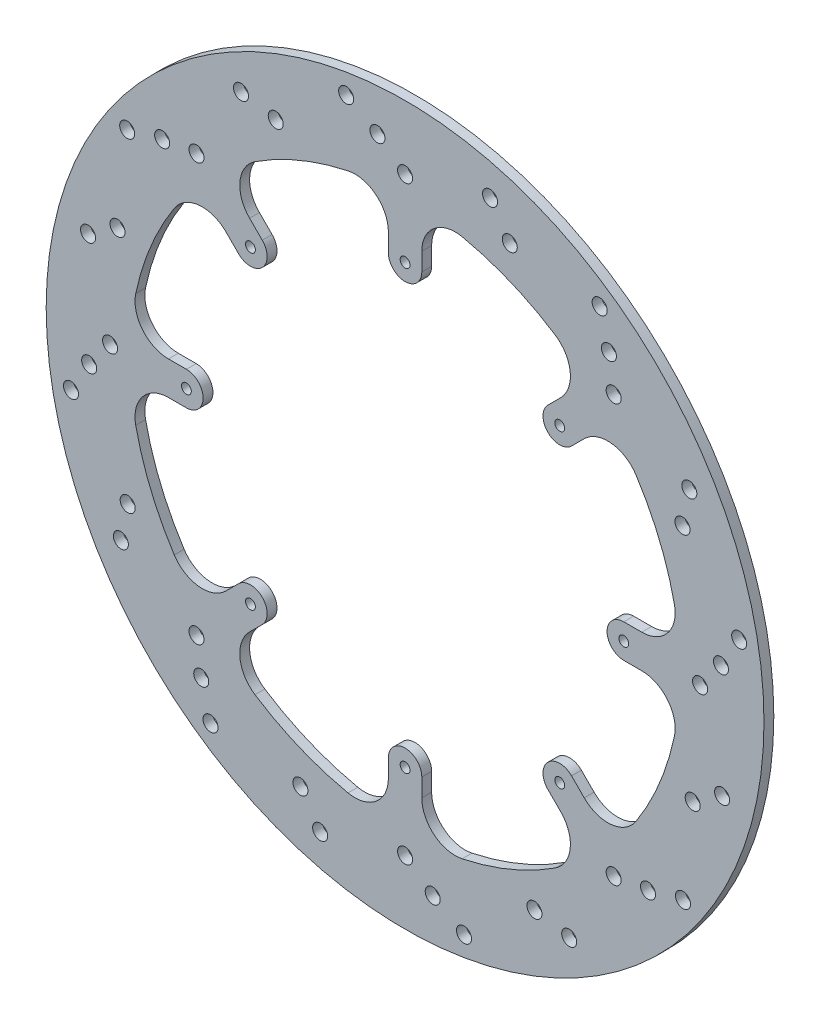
from build123d import *

# Parameters (mm, degrees)
SKETCH1_R          = 115.8875
SKETCH1_R_2        = 57.15
EXTRUDE1_DEPTH     = 3.175
CUT_EXTRUDE1_REACH = 165.92
SKETCH2_R          = 1.5875
CIRPATTERN1_COUNT  = 8
CUT_EXTRUDE2_REACH = 165.92
SKETCH3_R          = 2.4257
CIRPATTERN2_COUNT  = 8


with BuildPart() as part:
    # Sketch1 → Extrude1 (new body)
    with BuildSketch(Plane.XY):
        Circle(SKETCH1_R)
        Circle(SKETCH1_R_2, mode=Mode.SUBTRACT)
    extrude(amount=EXTRUDE1_DEPTH)

    # Sketch2 → Cut-Extrude1 (cut, up to next)
    with BuildSketch(Plane.XY.offset(3.175), mode=Mode.PRIVATE) as cut_extrude1_sk1:
        with Locations((0, 70.612)):
            Circle(SKETCH2_R)
    cut_extrude1_tool1 = extrude(cut_extrude1_sk1.sketch, amount=-CUT_EXTRUDE1_REACH, mode=Mode.PRIVATE) & part.part
    # Sketch2 → Cut-Extrude1 (cut, up to next)
    with BuildSketch(Plane.XY.offset(3.175), mode=Mode.PRIVATE) as cut_extrude1_sk2:
        with BuildLine():
            Line((5.3975, 76.408075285), (5.3975, 70.612))
            ThreePointArc((5.3975, 70.612), (0, 65.2145), (-5.3975, 70.612))
            Line((-5.3975, 70.612), (-5.3975, 76.408075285))
            ThreePointArc((-5.3975, 76.408075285), (-9.396436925, 84.79530079), (-18.430487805, 86.968540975))
            ThreePointArc((-18.430487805, 86.968540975), (-31.833684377, 83.004979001), (-44.45, 76.989658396))
            Line((-44.45, 76.989658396), (0, 0))
            Line((0, 0), (44.45, 76.989658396))
            ThreePointArc((44.45, 76.989658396), (31.833684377, 83.004979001), (18.430487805, 86.968540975))
            ThreePointArc((18.430487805, 86.968540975), (9.396436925, 84.79530079), (5.3975, 76.408075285))
        make_face()
    cut_extrude1_tool2 = extrude(cut_extrude1_sk2.sketch, amount=-CUT_EXTRUDE1_REACH, mode=Mode.PRIVATE) & part.part
    cut_extrude1_1 = cut_extrude1_tool1.solids().sort_by_distance((0, 70.612, 3.175))[0]
    add(cut_extrude1_1, mode=Mode.SUBTRACT)
    cut_extrude1_2 = cut_extrude1_tool2.solids().sort_by_distance((0, 54.720069, 3.175))[0]
    add(cut_extrude1_2, mode=Mode.SUBTRACT)
    cut_extrude1 = cut_extrude1_1 + cut_extrude1_2  # Cut-Extrude1 as one shape, for the pattern or mirror that repeats it

    # CirPattern1: Cut-Extrude1 ×8 about axis
    cirpattern1_axis = Axis((0, 0, 0), (0, 0, 1))
    for i in range(1, CIRPATTERN1_COUNT):
        add(cut_extrude1.rotate(cirpattern1_axis, i * 360 / CIRPATTERN1_COUNT), mode=Mode.SUBTRACT)

    # Sketch3 → Cut-Extrude2 (cut, up to next)
    with BuildSketch(Plane.XY.offset(3.175), mode=Mode.PRIVATE) as cut_extrude2_sk1:
        with Locations((0, 95.25)):
            Circle(SKETCH3_R)
    cut_extrude2_tool1 = extrude(cut_extrude2_sk1.sketch, amount=-CUT_EXTRUDE2_REACH, mode=Mode.PRIVATE) & part.part
    # Sketch3 → Cut-Extrude2 (cut, up to next)
    with BuildSketch(Plane.XY.offset(3.175), mode=Mode.PRIVATE) as cut_extrude2_sk2:
        with Locations((-8.924203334, 102.004110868)):
            Circle(SKETCH3_R)
    cut_extrude2_tool2 = extrude(cut_extrude2_sk2.sketch, amount=-CUT_EXTRUDE2_REACH, mode=Mode.PRIVATE) & part.part
    # Sketch3 → Cut-Extrude2 (cut, up to next)
    with BuildSketch(Plane.XY.offset(3.175), mode=Mode.PRIVATE) as cut_extrude2_sk3:
        with Locations((-19.020987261, 107.873379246)):
            Circle(SKETCH3_R)
    cut_extrude2_tool3 = extrude(cut_extrude2_sk3.sketch, amount=-CUT_EXTRUDE2_REACH, mode=Mode.PRIVATE) & part.part
    # Sketch3 → Cut-Extrude2 (cut, up to next)
    with BuildSketch(Plane.XY.offset(3.175), mode=Mode.PRIVATE) as cut_extrude2_sk4:
        with Locations((27.425921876, 102.354933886)):
            Circle(SKETCH3_R)
    cut_extrude2_tool4 = extrude(cut_extrude2_sk4.sketch, amount=-CUT_EXTRUDE2_REACH, mode=Mode.PRIVATE) & part.part
    # Sketch3 → Cut-Extrude2 (cut, up to next)
    with BuildSketch(Plane.XY.offset(3.175), mode=Mode.PRIVATE) as cut_extrude2_sk5:
        with Locations((33.799071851, 92.86218671)):
            Circle(SKETCH3_R)
    cut_extrude2_tool5 = extrude(cut_extrude2_sk5.sketch, amount=-CUT_EXTRUDE2_REACH, mode=Mode.PRIVATE) & part.part
    cut_extrude2_1 = cut_extrude2_tool1.solids().sort_by_distance((0, 95.25, 3.175))[0]
    add(cut_extrude2_1, mode=Mode.SUBTRACT)
    cut_extrude2_2 = cut_extrude2_tool2.solids().sort_by_distance((-8.924203, 102.004111, 3.175))[0]
    add(cut_extrude2_2, mode=Mode.SUBTRACT)
    cut_extrude2_3 = cut_extrude2_tool3.solids().sort_by_distance((-19.020987, 107.873379, 3.175))[0]
    add(cut_extrude2_3, mode=Mode.SUBTRACT)
    cut_extrude2_4 = cut_extrude2_tool4.solids().sort_by_distance((27.425922, 102.354934, 3.175))[0]
    add(cut_extrude2_4, mode=Mode.SUBTRACT)
    cut_extrude2_5 = cut_extrude2_tool5.solids().sort_by_distance((33.799072, 92.862187, 3.175))[0]
    add(cut_extrude2_5, mode=Mode.SUBTRACT)
    cut_extrude2 = cut_extrude2_1 + cut_extrude2_2 + cut_extrude2_3 + cut_extrude2_4 + cut_extrude2_5  # Cut-Extrude2 as one shape, for the pattern or mirror that repeats it

    # CirPattern2: Cut-Extrude2 ×8 about axis
    cirpattern2_axis = Axis((0, 0, 0), (0, 0, 1))
    for i in range(1, CIRPATTERN2_COUNT):
        add(cut_extrude2.rotate(cirpattern2_axis, i * 360 / CIRPATTERN2_COUNT), mode=Mode.SUBTRACT)


solid = part.part
